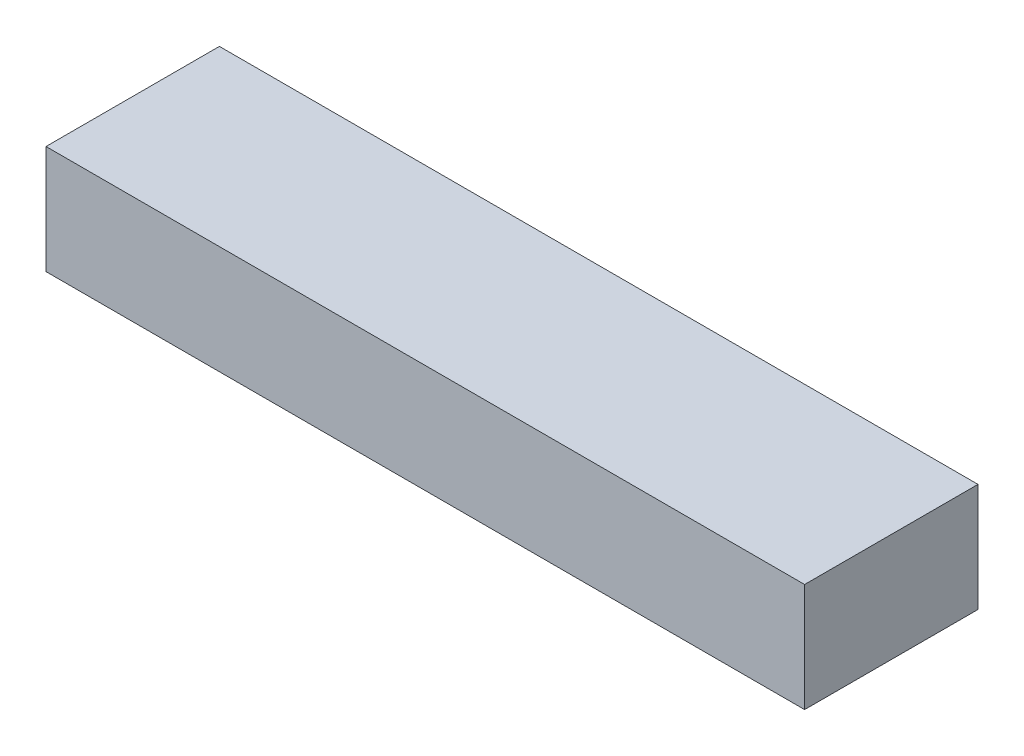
from build123d import *

# Parameters (mm, degrees)
ESQUISSE1_W      = 35
ESQUISSE1_H      = 5
EXTRUSION1_DEPTH = 8


with BuildPart() as part:
    # Esquisse1 → Extrusion1 (new body)
    with BuildSketch(Plane.XY):
        with Locations((17.5, 2.5)):
            Rectangle(ESQUISSE1_W, ESQUISSE1_H)
    extrude(amount=EXTRUSION1_DEPTH)


solid = part.part
